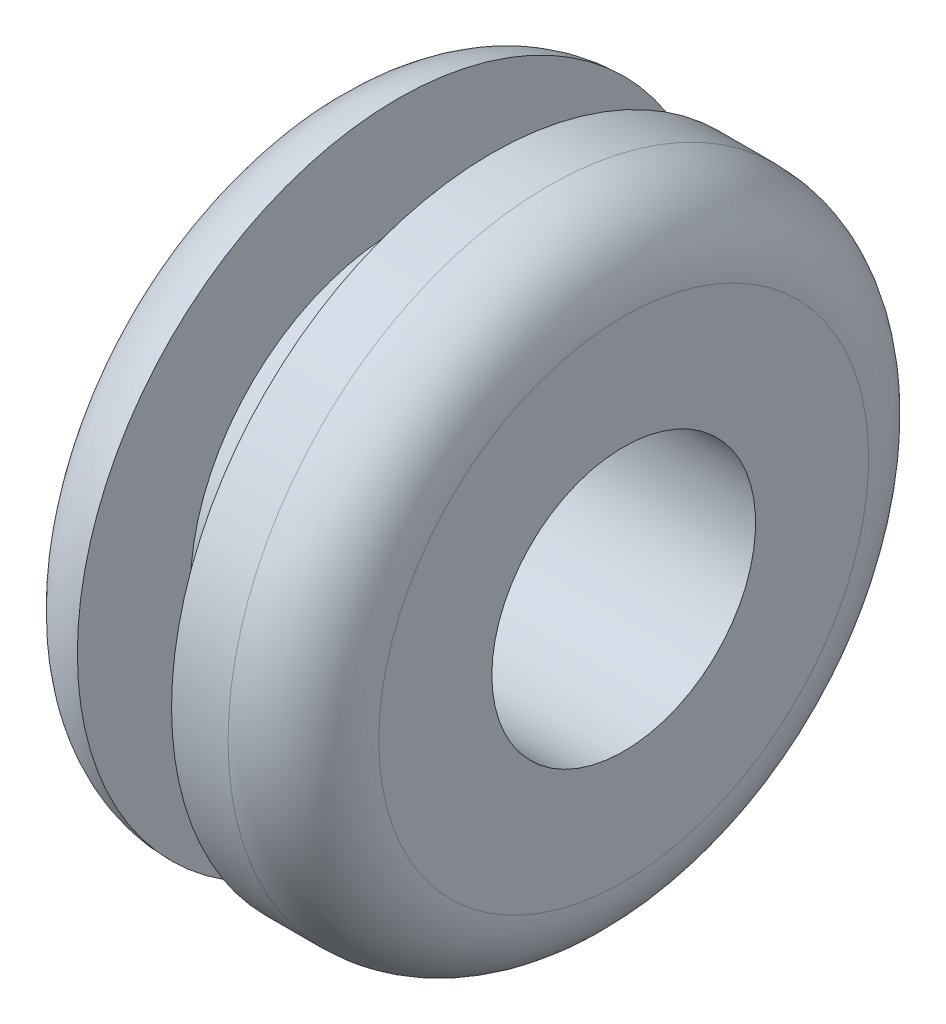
ISO-10303-21;
HEADER;
FILE_DESCRIPTION(('STEP AP214'),'2;1');
FILE_NAME('part.step','',(''),(''),'','','');
FILE_SCHEMA(('AUTOMOTIVE_DESIGN { 1 0 10303 214 1 1 1 1 }'));
ENDSEC;
DATA;
#1=APPLICATION_CONTEXT('core data for automotive mechanical design processes');
#2=APPLICATION_PROTOCOL_DEFINITION('international standard','automotive_design',2000,#1);
#3=PRODUCT_CONTEXT('',#1,'mechanical');
#4=PRODUCT('Part','Part','',(#3));
#5=PRODUCT_RELATED_PRODUCT_CATEGORY('part','',(#4));
#6=PRODUCT_DEFINITION_FORMATION('','',#4);
#7=PRODUCT_DEFINITION_CONTEXT('part definition',#1,'design');
#8=PRODUCT_DEFINITION('design','',#6,#7);
#9=PRODUCT_DEFINITION_SHAPE('','',#8);
#10=(LENGTH_UNIT() NAMED_UNIT(*) SI_UNIT(.MILLI.,.METRE.));
#11=(NAMED_UNIT(*) PLANE_ANGLE_UNIT() SI_UNIT($,.RADIAN.));
#12=(NAMED_UNIT(*) SI_UNIT($,.STERADIAN.) SOLID_ANGLE_UNIT());
#13=UNCERTAINTY_MEASURE_WITH_UNIT(LENGTH_MEASURE(1.E-05),#10,'distance_accuracy_value','');
#14=(GEOMETRIC_REPRESENTATION_CONTEXT(3) GLOBAL_UNCERTAINTY_ASSIGNED_CONTEXT((#13)) GLOBAL_UNIT_ASSIGNED_CONTEXT((#10,
#11,#12)) REPRESENTATION_CONTEXT('',''));
#15=CARTESIAN_POINT('',(0.,0.,0.));
#16=DIRECTION('',(0.,0.,1.));
#17=DIRECTION('',(1.,0.,0.));
#18=AXIS2_PLACEMENT_3D('',#15,#16,#17);
#19=CARTESIAN_POINT('',(2.,0.,0.));
#20=DIRECTION('',(-1.,0.,0.));
#21=DIRECTION('',(0.,0.,1.));
#22=AXIS2_PLACEMENT_3D('',#19,#20,#21);
#23=TOROIDAL_SURFACE('',#22,6.5,2.);
#24=CARTESIAN_POINT('',(0.,0.,0.));
#25=DIRECTION('',(-1.,0.,0.));
#26=DIRECTION('',(0.,0.,1.));
#27=AXIS2_PLACEMENT_3D('',#24,#25,#26);
#28=CIRCLE('',#27,6.5);
#29=CARTESIAN_POINT('',(0.,0.,6.50000000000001));
#30=VERTEX_POINT('',#29);
#31=EDGE_CURVE('E75',#30,#30,#28,.T.);
#32=ORIENTED_EDGE('',*,*,#31,.F.);
#33=EDGE_LOOP('',(#32));
#34=FACE_BOUND('',#33,.T.);
#35=CARTESIAN_POINT('',(2.,0.,0.));
#36=DIRECTION('',(-1.,0.,0.));
#37=DIRECTION('',(0.,0.,1.));
#38=AXIS2_PLACEMENT_3D('',#35,#36,#37);
#39=CIRCLE('',#38,8.5);
#40=CARTESIAN_POINT('',(2.,0.,8.50000000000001));
#41=VERTEX_POINT('',#40);
#42=EDGE_CURVE('E10',#41,#41,#39,.T.);
#43=ORIENTED_EDGE('',*,*,#42,.T.);
#44=EDGE_LOOP('',(#43));
#45=FACE_BOUND('',#44,.T.);
#46=ADVANCED_FACE('F36',(#34,#45),#23,.T.);
#47=CARTESIAN_POINT('',(1.99999999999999,8.4999999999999,0.));
#48=DIRECTION('',(-1.,0.,0.));
#49=DIRECTION('',(0.,0.,1.));
#50=AXIS2_PLACEMENT_3D('',#47,#48,#49);
#51=PLANE('',#50);
#52=ORIENTED_EDGE('',*,*,#42,.F.);
#53=EDGE_LOOP('',(#52));
#54=FACE_BOUND('',#53,.T.);
#55=CARTESIAN_POINT('',(2.,0.,0.));
#56=DIRECTION('',(-1.,0.,0.));
#57=DIRECTION('',(0.,0.,1.));
#58=AXIS2_PLACEMENT_3D('',#55,#56,#57);
#59=CIRCLE('',#58,5.5);
#60=CARTESIAN_POINT('',(2.,0.,5.50000000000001));
#61=VERTEX_POINT('',#60);
#62=EDGE_CURVE('E43',#61,#61,#59,.T.);
#63=ORIENTED_EDGE('',*,*,#62,.T.);
#64=EDGE_LOOP('',(#63));
#65=FACE_BOUND('',#64,.T.);
#66=ADVANCED_FACE('F83',(#54,#65),#51,.F.);
#67=CARTESIAN_POINT('',(0.,0.,0.));
#68=DIRECTION('',(-1.,0.,0.));
#69=DIRECTION('',(0.,0.,1.));
#70=AXIS2_PLACEMENT_3D('',#67,#68,#69);
#71=CYLINDRICAL_SURFACE('',#70,5.5);
#72=ORIENTED_EDGE('',*,*,#62,.F.);
#73=EDGE_LOOP('',(#72));
#74=FACE_BOUND('',#73,.T.);
#75=CARTESIAN_POINT('',(4.49999999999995,0.,2.77555756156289E-13));
#76=DIRECTION('',(-1.,0.,0.));
#77=DIRECTION('',(0.,0.,1.));
#78=AXIS2_PLACEMENT_3D('',#75,#76,#77);
#79=CIRCLE('',#78,5.5);
#80=CARTESIAN_POINT('',(4.49999999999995,0.,5.50000000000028));
#81=VERTEX_POINT('',#80);
#82=EDGE_CURVE('E50',#81,#81,#79,.T.);
#83=ORIENTED_EDGE('',*,*,#82,.T.);
#84=EDGE_LOOP('',(#83));
#85=FACE_BOUND('',#84,.T.);
#86=ADVANCED_FACE('F87',(#74,#85),#71,.T.);
#87=CARTESIAN_POINT('',(4.50000000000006,5.50000000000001,0.));
#88=DIRECTION('',(1.,0.,0.));
#89=DIRECTION('',(0.,0.,-1.));
#90=AXIS2_PLACEMENT_3D('',#87,#88,#89);
#91=PLANE('',#90);
#92=ORIENTED_EDGE('',*,*,#82,.F.);
#93=EDGE_LOOP('',(#92));
#94=FACE_BOUND('',#93,.T.);
#95=CARTESIAN_POINT('',(4.49999999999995,0.,2.77555756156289E-13));
#96=DIRECTION('',(-1.,0.,0.));
#97=DIRECTION('',(0.,0.,1.));
#98=AXIS2_PLACEMENT_3D('',#95,#96,#97);
#99=CIRCLE('',#98,8.5);
#100=CARTESIAN_POINT('',(4.49999999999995,0.,8.50000000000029));
#101=VERTEX_POINT('',#100);
#102=EDGE_CURVE('E56',#101,#101,#99,.T.);
#103=ORIENTED_EDGE('',*,*,#102,.T.);
#104=EDGE_LOOP('',(#103));
#105=FACE_BOUND('',#104,.T.);
#106=ADVANCED_FACE('F92',(#94,#105),#91,.F.);
#107=CARTESIAN_POINT('',(0.,0.,0.));
#108=DIRECTION('',(-1.,0.,0.));
#109=DIRECTION('',(0.,0.,1.));
#110=AXIS2_PLACEMENT_3D('',#107,#108,#109);
#111=CYLINDRICAL_SURFACE('',#110,8.5);
#112=ORIENTED_EDGE('',*,*,#102,.F.);
#113=EDGE_LOOP('',(#112));
#114=FACE_BOUND('',#113,.T.);
#115=CARTESIAN_POINT('',(6.00000000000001,0.,2.77555756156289E-13));
#116=DIRECTION('',(-1.,0.,0.));
#117=DIRECTION('',(0.,0.,1.));
#118=AXIS2_PLACEMENT_3D('',#115,#116,#117);
#119=CIRCLE('',#118,8.5);
#120=CARTESIAN_POINT('',(6.00000000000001,0.,8.50000000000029));
#121=VERTEX_POINT('',#120);
#122=EDGE_CURVE('E61',#121,#121,#119,.T.);
#123=ORIENTED_EDGE('',*,*,#122,.T.);
#124=EDGE_LOOP('',(#123));
#125=FACE_BOUND('',#124,.T.);
#126=ADVANCED_FACE('F98',(#114,#125),#111,.T.);
#127=CARTESIAN_POINT('',(6.00000000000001,0.,2.77555756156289E-13));
#128=DIRECTION('',(-1.,0.,0.));
#129=DIRECTION('',(0.,0.,1.));
#130=AXIS2_PLACEMENT_3D('',#127,#128,#129);
#131=TOROIDAL_SURFACE('',#130,6.5,2.);
#132=ORIENTED_EDGE('',*,*,#122,.F.);
#133=EDGE_LOOP('',(#132));
#134=FACE_BOUND('',#133,.T.);
#135=CARTESIAN_POINT('',(8.,0.,2.77555756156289E-13));
#136=DIRECTION('',(-1.,0.,0.));
#137=DIRECTION('',(0.,0.,1.));
#138=AXIS2_PLACEMENT_3D('',#135,#136,#137);
#139=CIRCLE('',#138,6.5);
#140=CARTESIAN_POINT('',(8.,0.,6.50000000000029));
#141=VERTEX_POINT('',#140);
#142=EDGE_CURVE('E64',#141,#141,#139,.T.);
#143=ORIENTED_EDGE('',*,*,#142,.T.);
#144=EDGE_LOOP('',(#143));
#145=FACE_BOUND('',#144,.T.);
#146=ADVANCED_FACE('F102',(#134,#145),#131,.T.);
#147=CARTESIAN_POINT('',(8.,6.49999999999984,0.));
#148=DIRECTION('',(-1.,0.,0.));
#149=DIRECTION('',(0.,0.,1.));
#150=AXIS2_PLACEMENT_3D('',#147,#148,#149);
#151=PLANE('',#150);
#152=ORIENTED_EDGE('',*,*,#142,.F.);
#153=EDGE_LOOP('',(#152));
#154=FACE_BOUND('',#153,.T.);
#155=CARTESIAN_POINT('',(8.,0.,2.77555756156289E-13));
#156=DIRECTION('',(-1.,0.,0.));
#157=DIRECTION('',(0.,0.,1.));
#158=AXIS2_PLACEMENT_3D('',#155,#156,#157);
#159=CIRCLE('',#158,3.5);
#160=CARTESIAN_POINT('',(8.,0.,3.50000000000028));
#161=VERTEX_POINT('',#160);
#162=EDGE_CURVE('E68',#161,#161,#159,.T.);
#163=ORIENTED_EDGE('',*,*,#162,.T.);
#164=EDGE_LOOP('',(#163));
#165=FACE_BOUND('',#164,.T.);
#166=ADVANCED_FACE('F106',(#154,#165),#151,.F.);
#167=CARTESIAN_POINT('',(0.,0.,0.));
#168=DIRECTION('',(-1.,0.,0.));
#169=DIRECTION('',(0.,0.,1.));
#170=AXIS2_PLACEMENT_3D('',#167,#168,#169);
#171=CYLINDRICAL_SURFACE('',#170,3.5);
#172=ORIENTED_EDGE('',*,*,#162,.F.);
#173=EDGE_LOOP('',(#172));
#174=FACE_BOUND('',#173,.T.);
#175=CARTESIAN_POINT('',(0.,0.,0.));
#176=DIRECTION('',(-1.,0.,0.));
#177=DIRECTION('',(0.,0.,1.));
#178=AXIS2_PLACEMENT_3D('',#175,#176,#177);
#179=CIRCLE('',#178,3.5);
#180=CARTESIAN_POINT('',(0.,0.,3.5));
#181=VERTEX_POINT('',#180);
#182=EDGE_CURVE('E72',#181,#181,#179,.T.);
#183=ORIENTED_EDGE('',*,*,#182,.T.);
#184=EDGE_LOOP('',(#183));
#185=FACE_BOUND('',#184,.T.);
#186=ADVANCED_FACE('F110',(#174,#185),#171,.F.);
#187=CARTESIAN_POINT('',(0.,3.49999999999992,0.));
#188=DIRECTION('',(1.,0.,0.));
#189=DIRECTION('',(0.,0.,-1.));
#190=AXIS2_PLACEMENT_3D('',#187,#188,#189);
#191=PLANE('',#190);
#192=ORIENTED_EDGE('',*,*,#182,.F.);
#193=EDGE_LOOP('',(#192));
#194=FACE_BOUND('',#193,.T.);
#195=ORIENTED_EDGE('',*,*,#31,.T.);
#196=EDGE_LOOP('',(#195));
#197=FACE_BOUND('',#196,.T.);
#198=ADVANCED_FACE('F80',(#194,#197),#191,.F.);
#199=CLOSED_SHELL('',(#46,#66,#86,#106,#126,#146,#166,#186,#198));
#200=MANIFOLD_SOLID_BREP('B2',#199);
#201=ADVANCED_BREP_SHAPE_REPRESENTATION('',(#18,#200),#14);
#202=SHAPE_DEFINITION_REPRESENTATION(#9,#201);
ENDSEC;
END-ISO-10303-21;
